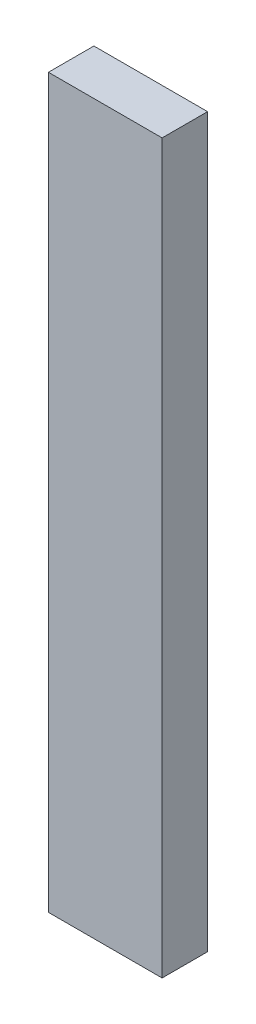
ISO-10303-21;
HEADER;
FILE_DESCRIPTION(('STEP AP214'),'2;1');
FILE_NAME('part.step','',(''),(''),'','','');
FILE_SCHEMA(('AUTOMOTIVE_DESIGN { 1 0 10303 214 1 1 1 1 }'));
ENDSEC;
DATA;
#1=APPLICATION_CONTEXT('core data for automotive mechanical design processes');
#2=APPLICATION_PROTOCOL_DEFINITION('international standard','automotive_design',2000,#1);
#3=PRODUCT_CONTEXT('',#1,'mechanical');
#4=PRODUCT('Part','Part','',(#3));
#5=PRODUCT_RELATED_PRODUCT_CATEGORY('part','',(#4));
#6=PRODUCT_DEFINITION_FORMATION('','',#4);
#7=PRODUCT_DEFINITION_CONTEXT('part definition',#1,'design');
#8=PRODUCT_DEFINITION('design','',#6,#7);
#9=PRODUCT_DEFINITION_SHAPE('','',#8);
#10=(LENGTH_UNIT() NAMED_UNIT(*) SI_UNIT(.MILLI.,.METRE.));
#11=(NAMED_UNIT(*) PLANE_ANGLE_UNIT() SI_UNIT($,.RADIAN.));
#12=(NAMED_UNIT(*) SI_UNIT($,.STERADIAN.) SOLID_ANGLE_UNIT());
#13=UNCERTAINTY_MEASURE_WITH_UNIT(LENGTH_MEASURE(1.E-05),#10,'distance_accuracy_value','');
#14=(GEOMETRIC_REPRESENTATION_CONTEXT(3) GLOBAL_UNCERTAINTY_ASSIGNED_CONTEXT((#13)) GLOBAL_UNIT_ASSIGNED_CONTEXT((#10,
#11,#12)) REPRESENTATION_CONTEXT('',''));
#15=CARTESIAN_POINT('',(0.,0.,0.));
#16=DIRECTION('',(0.,0.,1.));
#17=DIRECTION('',(1.,0.,0.));
#18=AXIS2_PLACEMENT_3D('',#15,#16,#17);
#19=CARTESIAN_POINT('',(0.,0.,10.));
#20=DIRECTION('',(1.,0.,0.));
#21=DIRECTION('',(0.,0.,-1.));
#22=AXIS2_PLACEMENT_3D('',#19,#20,#21);
#23=PLANE('',#22);
#24=DIRECTION('',(0.,-1.,0.));
#25=VECTOR('',#24,1.);
#26=CARTESIAN_POINT('',(0.,0.,0.));
#27=LINE('',#26,#25);
#28=CARTESIAN_POINT('',(0.,160.,0.));
#29=VERTEX_POINT('',#28);
#30=CARTESIAN_POINT('',(0.,0.,0.));
#31=VERTEX_POINT('',#30);
#32=EDGE_CURVE('E96',#29,#31,#27,.T.);
#33=ORIENTED_EDGE('',*,*,#32,.T.);
#34=DIRECTION('',(0.,0.,-1.));
#35=VECTOR('',#34,1.);
#36=CARTESIAN_POINT('',(0.,0.,10.));
#37=LINE('',#36,#35);
#38=CARTESIAN_POINT('',(0.,0.,10.));
#39=VERTEX_POINT('',#38);
#40=EDGE_CURVE('E11',#39,#31,#37,.T.);
#41=ORIENTED_EDGE('',*,*,#40,.F.);
#42=DIRECTION('',(0.,-1.,0.));
#43=VECTOR('',#42,1.);
#44=CARTESIAN_POINT('',(0.,0.,10.));
#45=LINE('',#44,#43);
#46=CARTESIAN_POINT('',(0.,160.,10.));
#47=VERTEX_POINT('',#46);
#48=EDGE_CURVE('E84',#47,#39,#45,.T.);
#49=ORIENTED_EDGE('',*,*,#48,.F.);
#50=DIRECTION('',(0.,0.,-1.));
#51=VECTOR('',#50,1.);
#52=CARTESIAN_POINT('',(0.,160.,10.));
#53=LINE('',#52,#51);
#54=EDGE_CURVE('E92',#47,#29,#53,.T.);
#55=ORIENTED_EDGE('',*,*,#54,.T.);
#56=EDGE_LOOP('',(#33,#41,#49,#55));
#57=FACE_BOUND('',#56,.T.);
#58=ADVANCED_FACE('F33',(#57),#23,.F.);
#59=CARTESIAN_POINT('',(0.,0.,10.));
#60=DIRECTION('',(0.,1.,0.));
#61=DIRECTION('',(0.,0.,1.));
#62=AXIS2_PLACEMENT_3D('',#59,#60,#61);
#63=PLANE('',#62);
#64=CARTESIAN_POINT('',(12.5,0.,5.));
#65=DIRECTION('',(0.,-1.,0.));
#66=DIRECTION('',(0.,0.,-1.));
#67=AXIS2_PLACEMENT_3D('',#64,#65,#66);
#68=CIRCLE('',#67,0.75);
#69=CARTESIAN_POINT('',(12.5,0.,4.25));
#70=VERTEX_POINT('',#69);
#71=EDGE_CURVE('E110',#70,#70,#68,.T.);
#72=ORIENTED_EDGE('',*,*,#71,.F.);
#73=EDGE_LOOP('',(#72));
#74=FACE_BOUND('',#73,.T.);
#75=DIRECTION('',(1.,0.,0.));
#76=VECTOR('',#75,1.);
#77=CARTESIAN_POINT('',(0.,0.,0.));
#78=LINE('',#77,#76);
#79=CARTESIAN_POINT('',(25.,0.,0.));
#80=VERTEX_POINT('',#79);
#81=EDGE_CURVE('E88',#31,#80,#78,.T.);
#82=ORIENTED_EDGE('',*,*,#81,.T.);
#83=DIRECTION('',(0.,0.,-1.));
#84=VECTOR('',#83,1.);
#85=CARTESIAN_POINT('',(25.,0.,10.));
#86=LINE('',#85,#84);
#87=CARTESIAN_POINT('',(25.,0.,10.));
#88=VERTEX_POINT('',#87);
#89=EDGE_CURVE('E41',#88,#80,#86,.T.);
#90=ORIENTED_EDGE('',*,*,#89,.F.);
#91=DIRECTION('',(1.,0.,0.));
#92=VECTOR('',#91,1.);
#93=CARTESIAN_POINT('',(0.,0.,10.));
#94=LINE('',#93,#92);
#95=EDGE_CURVE('E79',#39,#88,#94,.T.);
#96=ORIENTED_EDGE('',*,*,#95,.F.);
#97=ORIENTED_EDGE('',*,*,#40,.T.);
#98=EDGE_LOOP('',(#82,#90,#96,#97));
#99=FACE_BOUND('',#98,.T.);
#100=ADVANCED_FACE('F87',(#74,#99),#63,.F.);
#101=CARTESIAN_POINT('',(25.,0.,10.));
#102=DIRECTION('',(-1.,0.,0.));
#103=DIRECTION('',(0.,0.,1.));
#104=AXIS2_PLACEMENT_3D('',#101,#102,#103);
#105=PLANE('',#104);
#106=DIRECTION('',(0.,1.,0.));
#107=VECTOR('',#106,1.);
#108=CARTESIAN_POINT('',(25.,0.,0.));
#109=LINE('',#108,#107);
#110=CARTESIAN_POINT('',(25.,160.,0.));
#111=VERTEX_POINT('',#110);
#112=EDGE_CURVE('E66',#80,#111,#109,.T.);
#113=ORIENTED_EDGE('',*,*,#112,.T.);
#114=DIRECTION('',(0.,0.,-1.));
#115=VECTOR('',#114,1.);
#116=CARTESIAN_POINT('',(25.,160.,10.));
#117=LINE('',#116,#115);
#118=CARTESIAN_POINT('',(25.,160.,10.));
#119=VERTEX_POINT('',#118);
#120=EDGE_CURVE('E89',#119,#111,#117,.T.);
#121=ORIENTED_EDGE('',*,*,#120,.F.);
#122=DIRECTION('',(0.,1.,0.));
#123=VECTOR('',#122,1.);
#124=CARTESIAN_POINT('',(25.,0.,10.));
#125=LINE('',#124,#123);
#126=EDGE_CURVE('E82',#88,#119,#125,.T.);
#127=ORIENTED_EDGE('',*,*,#126,.F.);
#128=ORIENTED_EDGE('',*,*,#89,.T.);
#129=EDGE_LOOP('',(#113,#121,#127,#128));
#130=FACE_BOUND('',#129,.T.);
#131=ADVANCED_FACE('F90',(#130),#105,.F.);
#132=CARTESIAN_POINT('',(0.,160.,10.));
#133=DIRECTION('',(0.,-1.,0.));
#134=DIRECTION('',(0.,0.,-1.));
#135=AXIS2_PLACEMENT_3D('',#132,#133,#134);
#136=PLANE('',#135);
#137=DIRECTION('',(-1.,0.,0.));
#138=VECTOR('',#137,1.);
#139=CARTESIAN_POINT('',(0.,160.,0.));
#140=LINE('',#139,#138);
#141=EDGE_CURVE('E72',#111,#29,#140,.T.);
#142=ORIENTED_EDGE('',*,*,#141,.T.);
#143=ORIENTED_EDGE('',*,*,#54,.F.);
#144=DIRECTION('',(-1.,0.,0.));
#145=VECTOR('',#144,1.);
#146=CARTESIAN_POINT('',(0.,160.,10.));
#147=LINE('',#146,#145);
#148=EDGE_CURVE('E49',#119,#47,#147,.T.);
#149=ORIENTED_EDGE('',*,*,#148,.F.);
#150=ORIENTED_EDGE('',*,*,#120,.T.);
#151=EDGE_LOOP('',(#142,#143,#149,#150));
#152=FACE_BOUND('',#151,.T.);
#153=ADVANCED_FACE('F104',(#152),#136,.F.);
#154=CARTESIAN_POINT('',(0.,0.,10.));
#155=DIRECTION('',(0.,0.,-1.));
#156=DIRECTION('',(-1.,0.,0.));
#157=AXIS2_PLACEMENT_3D('',#154,#155,#156);
#158=PLANE('',#157);
#159=ORIENTED_EDGE('',*,*,#48,.T.);
#160=ORIENTED_EDGE('',*,*,#95,.T.);
#161=ORIENTED_EDGE('',*,*,#126,.T.);
#162=ORIENTED_EDGE('',*,*,#148,.T.);
#163=EDGE_LOOP('',(#159,#160,#161,#162));
#164=FACE_BOUND('',#163,.T.);
#165=ADVANCED_FACE('F80',(#164),#158,.F.);
#166=CARTESIAN_POINT('',(0.,0.,0.));
#167=DIRECTION('',(0.,0.,-1.));
#168=DIRECTION('',(-1.,0.,0.));
#169=AXIS2_PLACEMENT_3D('',#166,#167,#168);
#170=PLANE('',#169);
#171=CARTESIAN_POINT('',(12.5,45.,0.));
#172=DIRECTION('',(0.,0.,-1.));
#173=DIRECTION('',(-1.,0.,0.));
#174=AXIS2_PLACEMENT_3D('',#171,#172,#173);
#175=CIRCLE('',#174,0.75);
#176=CARTESIAN_POINT('',(11.75,45.,0.));
#177=VERTEX_POINT('',#176);
#178=EDGE_CURVE('E134',#177,#177,#175,.T.);
#179=ORIENTED_EDGE('',*,*,#178,.F.);
#180=EDGE_LOOP('',(#179));
#181=FACE_BOUND('',#180,.T.);
#182=CARTESIAN_POINT('',(12.5,106.,0.));
#183=DIRECTION('',(0.,0.,-1.));
#184=DIRECTION('',(-1.,0.,0.));
#185=AXIS2_PLACEMENT_3D('',#182,#183,#184);
#186=CIRCLE('',#185,0.75);
#187=CARTESIAN_POINT('',(11.75,106.,0.));
#188=VERTEX_POINT('',#187);
#189=EDGE_CURVE('E128',#188,#188,#186,.T.);
#190=ORIENTED_EDGE('',*,*,#189,.F.);
#191=EDGE_LOOP('',(#190));
#192=FACE_BOUND('',#191,.T.);
#193=CARTESIAN_POINT('',(12.5,128.,0.));
#194=DIRECTION('',(0.,0.,-1.));
#195=DIRECTION('',(-1.,0.,0.));
#196=AXIS2_PLACEMENT_3D('',#193,#194,#195);
#197=CIRCLE('',#196,0.75);
#198=CARTESIAN_POINT('',(11.75,128.,0.));
#199=VERTEX_POINT('',#198);
#200=EDGE_CURVE('E122',#199,#199,#197,.T.);
#201=ORIENTED_EDGE('',*,*,#200,.F.);
#202=EDGE_LOOP('',(#201));
#203=FACE_BOUND('',#202,.T.);
#204=CARTESIAN_POINT('',(12.5,150.,0.));
#205=DIRECTION('',(0.,0.,-1.));
#206=DIRECTION('',(-1.,0.,0.));
#207=AXIS2_PLACEMENT_3D('',#204,#205,#206);
#208=CIRCLE('',#207,0.75);
#209=CARTESIAN_POINT('',(11.75,150.,0.));
#210=VERTEX_POINT('',#209);
#211=EDGE_CURVE('E116',#210,#210,#208,.T.);
#212=ORIENTED_EDGE('',*,*,#211,.F.);
#213=EDGE_LOOP('',(#212));
#214=FACE_BOUND('',#213,.T.);
#215=ORIENTED_EDGE('',*,*,#32,.F.);
#216=ORIENTED_EDGE('',*,*,#141,.F.);
#217=ORIENTED_EDGE('',*,*,#112,.F.);
#218=ORIENTED_EDGE('',*,*,#81,.F.);
#219=EDGE_LOOP('',(#215,#216,#217,#218));
#220=FACE_BOUND('',#219,.T.);
#221=ADVANCED_FACE('F107',(#181,#192,#203,#214,#220),#170,.T.);
#222=CARTESIAN_POINT('',(12.5,10.,5.));
#223=DIRECTION('',(0.,-1.,0.));
#224=DIRECTION('',(0.,0.,-1.));
#225=AXIS2_PLACEMENT_3D('',#222,#223,#224);
#226=CYLINDRICAL_SURFACE('',#225,0.75);
#227=CARTESIAN_POINT('',(12.5,10.,5.));
#228=DIRECTION('',(0.,-1.,0.));
#229=DIRECTION('',(0.,0.,-1.));
#230=AXIS2_PLACEMENT_3D('',#227,#228,#229);
#231=CIRCLE('',#230,0.75);
#232=CARTESIAN_POINT('',(12.5,10.,4.25));
#233=VERTEX_POINT('',#232);
#234=EDGE_CURVE('E99',#233,#233,#231,.T.);
#235=ORIENTED_EDGE('',*,*,#234,.F.);
#236=EDGE_LOOP('',(#235));
#237=FACE_BOUND('',#236,.T.);
#238=ORIENTED_EDGE('',*,*,#71,.T.);
#239=EDGE_LOOP('',(#238));
#240=FACE_BOUND('',#239,.T.);
#241=ADVANCED_FACE('F151',(#237,#240),#226,.F.);
#242=CARTESIAN_POINT('',(12.5,10.,5.));
#243=DIRECTION('',(0.,-1.,0.));
#244=DIRECTION('',(0.,0.,-1.));
#245=AXIS2_PLACEMENT_3D('',#242,#243,#244);
#246=PLANE('',#245);
#247=ORIENTED_EDGE('',*,*,#234,.T.);
#248=EDGE_LOOP('',(#247));
#249=FACE_BOUND('',#248,.T.);
#250=ADVANCED_FACE('F162',(#249),#246,.T.);
#251=CARTESIAN_POINT('',(12.5,150.,5.));
#252=DIRECTION('',(0.,0.,-1.));
#253=DIRECTION('',(-1.,0.,0.));
#254=AXIS2_PLACEMENT_3D('',#251,#252,#253);
#255=CYLINDRICAL_SURFACE('',#254,0.75);
#256=CARTESIAN_POINT('',(12.5,150.,5.));
#257=DIRECTION('',(0.,0.,-1.));
#258=DIRECTION('',(-1.,0.,0.));
#259=AXIS2_PLACEMENT_3D('',#256,#257,#258);
#260=CIRCLE('',#259,0.75);
#261=CARTESIAN_POINT('',(11.75,150.,5.));
#262=VERTEX_POINT('',#261);
#263=EDGE_CURVE('E113',#262,#262,#260,.T.);
#264=ORIENTED_EDGE('',*,*,#263,.F.);
#265=EDGE_LOOP('',(#264));
#266=FACE_BOUND('',#265,.T.);
#267=ORIENTED_EDGE('',*,*,#211,.T.);
#268=EDGE_LOOP('',(#267));
#269=FACE_BOUND('',#268,.T.);
#270=ADVANCED_FACE('F159',(#266,#269),#255,.F.);
#271=CARTESIAN_POINT('',(12.5,150.,5.));
#272=DIRECTION('',(0.,0.,-1.));
#273=DIRECTION('',(-1.,0.,0.));
#274=AXIS2_PLACEMENT_3D('',#271,#272,#273);
#275=PLANE('',#274);
#276=ORIENTED_EDGE('',*,*,#263,.T.);
#277=EDGE_LOOP('',(#276));
#278=FACE_BOUND('',#277,.T.);
#279=ADVANCED_FACE('F161',(#278),#275,.T.);
#280=CARTESIAN_POINT('',(12.5,128.,5.));
#281=DIRECTION('',(0.,0.,-1.));
#282=DIRECTION('',(-1.,0.,0.));
#283=AXIS2_PLACEMENT_3D('',#280,#281,#282);
#284=CYLINDRICAL_SURFACE('',#283,0.75);
#285=CARTESIAN_POINT('',(12.5,128.,5.));
#286=DIRECTION('',(0.,0.,-1.));
#287=DIRECTION('',(-1.,0.,0.));
#288=AXIS2_PLACEMENT_3D('',#285,#286,#287);
#289=CIRCLE('',#288,0.75);
#290=CARTESIAN_POINT('',(11.75,128.,5.));
#291=VERTEX_POINT('',#290);
#292=EDGE_CURVE('E119',#291,#291,#289,.T.);
#293=ORIENTED_EDGE('',*,*,#292,.F.);
#294=EDGE_LOOP('',(#293));
#295=FACE_BOUND('',#294,.T.);
#296=ORIENTED_EDGE('',*,*,#200,.T.);
#297=EDGE_LOOP('',(#296));
#298=FACE_BOUND('',#297,.T.);
#299=ADVANCED_FACE('F169',(#295,#298),#284,.F.);
#300=CARTESIAN_POINT('',(12.5,128.,5.));
#301=DIRECTION('',(0.,0.,-1.));
#302=DIRECTION('',(-1.,0.,0.));
#303=AXIS2_PLACEMENT_3D('',#300,#301,#302);
#304=PLANE('',#303);
#305=ORIENTED_EDGE('',*,*,#292,.T.);
#306=EDGE_LOOP('',(#305));
#307=FACE_BOUND('',#306,.T.);
#308=ADVANCED_FACE('F224',(#307),#304,.T.);
#309=CARTESIAN_POINT('',(12.5,106.,5.));
#310=DIRECTION('',(0.,0.,-1.));
#311=DIRECTION('',(-1.,0.,0.));
#312=AXIS2_PLACEMENT_3D('',#309,#310,#311);
#313=CYLINDRICAL_SURFACE('',#312,0.75);
#314=CARTESIAN_POINT('',(12.5,106.,5.));
#315=DIRECTION('',(0.,0.,-1.));
#316=DIRECTION('',(-1.,0.,0.));
#317=AXIS2_PLACEMENT_3D('',#314,#315,#316);
#318=CIRCLE('',#317,0.75);
#319=CARTESIAN_POINT('',(11.75,106.,5.));
#320=VERTEX_POINT('',#319);
#321=EDGE_CURVE('E125',#320,#320,#318,.T.);
#322=ORIENTED_EDGE('',*,*,#321,.F.);
#323=EDGE_LOOP('',(#322));
#324=FACE_BOUND('',#323,.T.);
#325=ORIENTED_EDGE('',*,*,#189,.T.);
#326=EDGE_LOOP('',(#325));
#327=FACE_BOUND('',#326,.T.);
#328=ADVANCED_FACE('F234',(#324,#327),#313,.F.);
#329=CARTESIAN_POINT('',(12.5,106.,5.));
#330=DIRECTION('',(0.,0.,-1.));
#331=DIRECTION('',(-1.,0.,0.));
#332=AXIS2_PLACEMENT_3D('',#329,#330,#331);
#333=PLANE('',#332);
#334=ORIENTED_EDGE('',*,*,#321,.T.);
#335=EDGE_LOOP('',(#334));
#336=FACE_BOUND('',#335,.T.);
#337=ADVANCED_FACE('F145',(#336),#333,.T.);
#338=CARTESIAN_POINT('',(12.5,45.,5.));
#339=DIRECTION('',(0.,0.,-1.));
#340=DIRECTION('',(-1.,0.,0.));
#341=AXIS2_PLACEMENT_3D('',#338,#339,#340);
#342=CYLINDRICAL_SURFACE('',#341,0.75);
#343=CARTESIAN_POINT('',(12.5,45.,5.));
#344=DIRECTION('',(0.,0.,-1.));
#345=DIRECTION('',(-1.,0.,0.));
#346=AXIS2_PLACEMENT_3D('',#343,#344,#345);
#347=CIRCLE('',#346,0.75);
#348=CARTESIAN_POINT('',(11.75,45.,5.));
#349=VERTEX_POINT('',#348);
#350=EDGE_CURVE('E131',#349,#349,#347,.T.);
#351=ORIENTED_EDGE('',*,*,#350,.F.);
#352=EDGE_LOOP('',(#351));
#353=FACE_BOUND('',#352,.T.);
#354=ORIENTED_EDGE('',*,*,#178,.T.);
#355=EDGE_LOOP('',(#354));
#356=FACE_BOUND('',#355,.T.);
#357=ADVANCED_FACE('F142',(#353,#356),#342,.F.);
#358=CARTESIAN_POINT('',(12.5,45.,5.));
#359=DIRECTION('',(0.,0.,-1.));
#360=DIRECTION('',(-1.,0.,0.));
#361=AXIS2_PLACEMENT_3D('',#358,#359,#360);
#362=PLANE('',#361);
#363=ORIENTED_EDGE('',*,*,#350,.T.);
#364=EDGE_LOOP('',(#363));
#365=FACE_BOUND('',#364,.T.);
#366=ADVANCED_FACE('F140',(#365),#362,.T.);
#367=CLOSED_SHELL('',(#58,#100,#131,#153,#165,#221,#241,#250,#270,#279,#299,#308,#328,#337,#357,#366));
#368=MANIFOLD_SOLID_BREP('B2',#367);
#369=ADVANCED_BREP_SHAPE_REPRESENTATION('',(#18,#368),#14);
#370=SHAPE_DEFINITION_REPRESENTATION(#9,#369);
ENDSEC;
END-ISO-10303-21;
